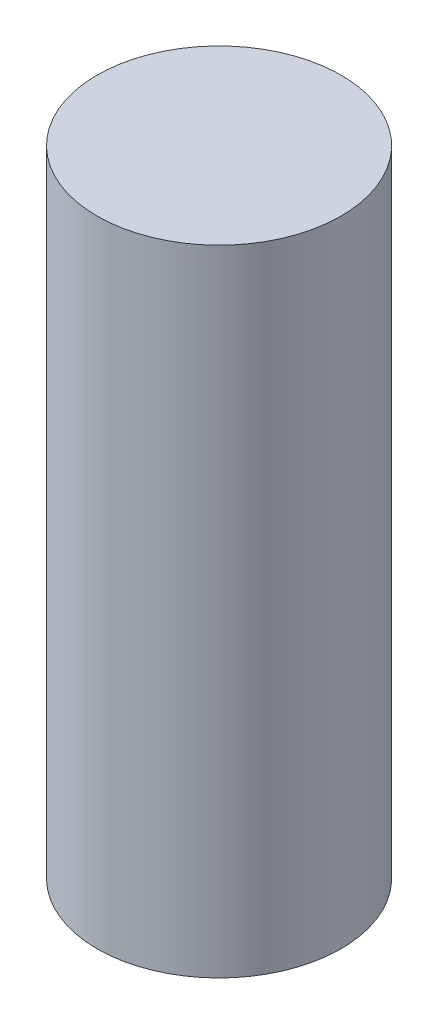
from build123d import *

# Parameters (mm, degrees)
SKETCH1_R           = 0.5
BOSS_EXTRUDE1_DEPTH = 2.6


with BuildPart() as part:
    # Sketch1 → Boss-Extrude1 (new body)
    with BuildSketch(Plane(origin=(0, 0, 0), x_dir=(1, 0, 0), z_dir=(0, 1, 0))):
        with Locations(Location((0, 0, 0), (0, 0, 270))):
            Circle(SKETCH1_R)
    extrude(amount=BOSS_EXTRUDE1_DEPTH)


solid = part.part
